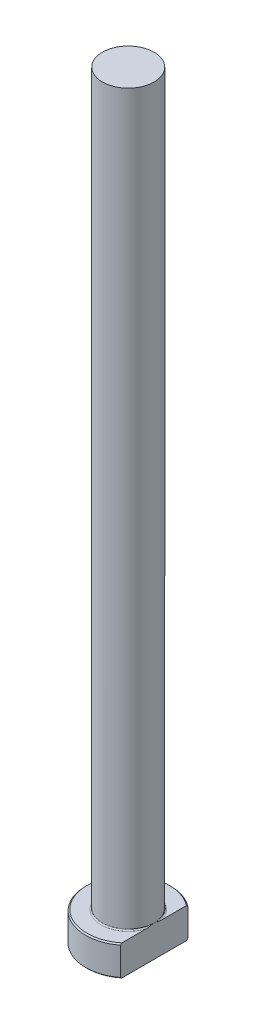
from build123d import *
from build123d.topology import SkipClean

# Parameters (mm, degrees)
CHAMFER1_SIZE = 0.2
FILLET1_R     = 0.2
KEY_DEPTH     = 126.391387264


with BuildPart() as part:
    # Sketch1 → Revolve1 (revolve)
    with BuildSketch(Plane.XY, mode=Mode.PRIVATE) as revolve1_sk:
        Polygon((0, 0), (-7, 0), (-7, 5), (-4.25, 5), (-4.25, 125), (0, 125), align=None)
    revolve(revolve1_sk.sketch.rotate(Axis((0, 259.958771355, 0), (0, -1, 0)), 270), axis=Axis((0, 259.958771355, 0), (0, -1, 0)))

    # Chamfer1
    chamfer1_edges = [part.edges().sort_by_distance(p)[0] for p in [
        (0, 5, -7),
        (0, 0, -7),
    ]]
    chamfer(chamfer1_edges, length=CHAMFER1_SIZE)

    # Fillet1
    fillet1_edges = [part.edges().sort_by_distance(p)[0] for p in [
        (0, 5, -4.25),
    ]]
    fillet(fillet1_edges, radius=FILLET1_R)

    # Sketch2 → KEY (cut, through all)
    with SkipClean():  # the faces are left unmerged after this step: merging them gives an invalid solid
        with BuildSketch(Plane(origin=(0, 0, 0), x_dir=(1, 0, 0), z_dir=(0, 1, 0))):
            with BuildLine():
                Line((4.25, 5.562148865), (4.25, -5.562148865))
                ThreePointArc((4.25, -5.562148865), (7, 0), (4.25, 5.562148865))
            make_face()
        extrude(amount=KEY_DEPTH, mode=Mode.SUBTRACT)


solid = part.part
